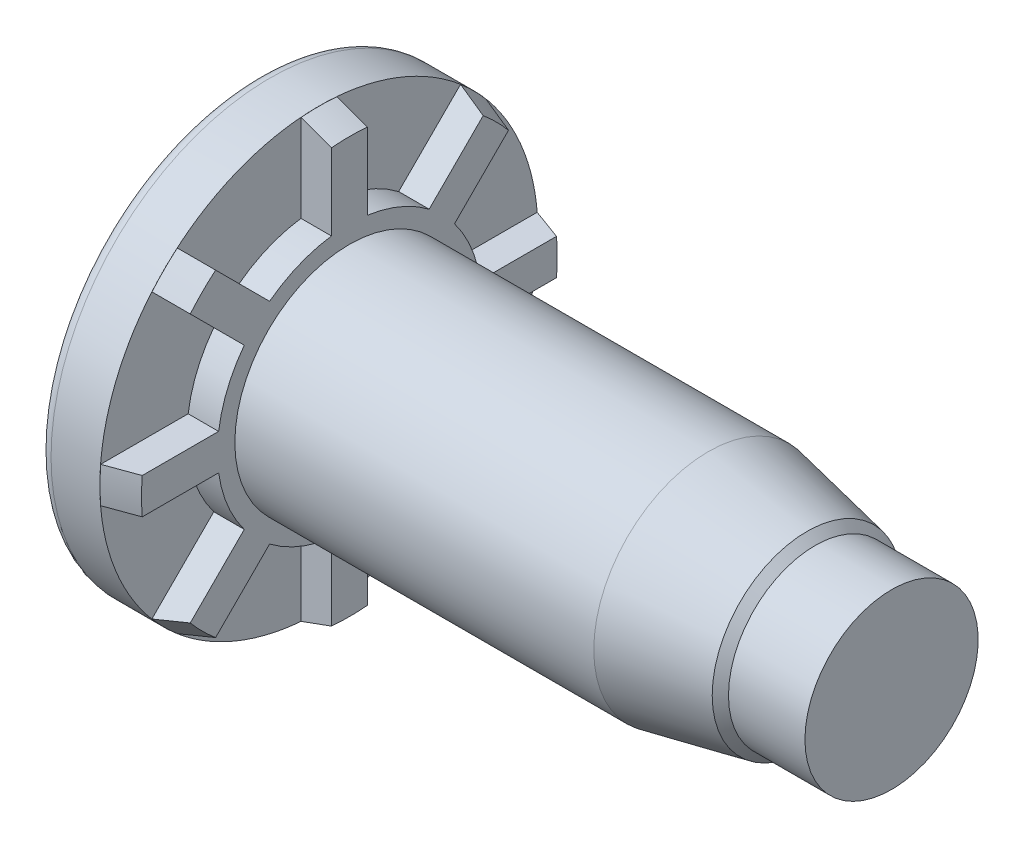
from build123d import *

# Parameters (mm, degrees)
RIBCUT_START     = -1.065
RIBCUT_DEPTH     = 1.065
RIBCUTSPAT_COUNT = 8
RIBCUTSPAT_ANGLE = 315


with BuildPart() as part:
    # BodySke → BaseBody (revolve)
    with BuildSketch(Plane.XY, mode=Mode.PRIVATE) as basebody_sk:
        with BuildLine():
            Line((-2.13, 7.224), (-2.13, 0))
            Line((-2.13, 0), (20, 0))
            Line((20, 0), (20, 3.025))
            Line((20, 3.025), (17.33, 3.025))
            Line((17.33, 3.025), (17.0455, 3.3095))
            Line((17.0455, 3.3095), (13.6, 4))
            Line((13.6, 4), (1.065, 4))
            Line((1.065, 4), (1.065, 7.260756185))
            Line((1.065, 7.260756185), (0.00254, 7.64746))
            Line((0.00254, 7.64746), (0, 7.64746))
            Line((0, 7.64746), (0, 7.65))
            Line((0, 7.65), (-1.704, 7.65))
            ThreePointArc((-1.704, 7.65), (-2.005227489, 7.525227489), (-2.13, 7.224))
        make_face()
    revolve(basebody_sk.sketch.rotate(Axis((0, 0, 0), (1, 0, 0)), 90), axis=Axis((0, 0, 0), (1, 0, 0)))

    # RibCutSke → RibCut (cut)
    with BuildSketch(Plane(origin=(1.065, 1.794401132, -0.090952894), x_dir=(0, 0, -1), z_dir=(1, 0, 0)).offset(RIBCUT_START)):
        with BuildLine():
            Line((0.534784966, 2.771251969), (0.534784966, 5.829964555))
            ThreePointArc((0.534784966, 5.829964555), (2.836575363, 5.273277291), (4.857824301, 4.039303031))
            Line((4.857824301, 4.039303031), (2.69498789, 1.87646662))
            ThreePointArc((2.69498789, 1.87646662), (1.672579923, 2.463143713), (0.534784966, 2.771251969))
        make_face()
    ribcut = extrude(amount=RIBCUT_DEPTH, mode=Mode.SUBTRACT)

    # RibCutsPat: RibCut ×8 about axis
    ribcutspat_axis = Axis((0, 0, 0), (1, 0, 0))
    for i in range(1, RIBCUTSPAT_COUNT):
        add(ribcut.rotate(ribcutspat_axis, i * RIBCUTSPAT_ANGLE / (RIBCUTSPAT_COUNT - 1)), mode=Mode.SUBTRACT)


solid = part.part
